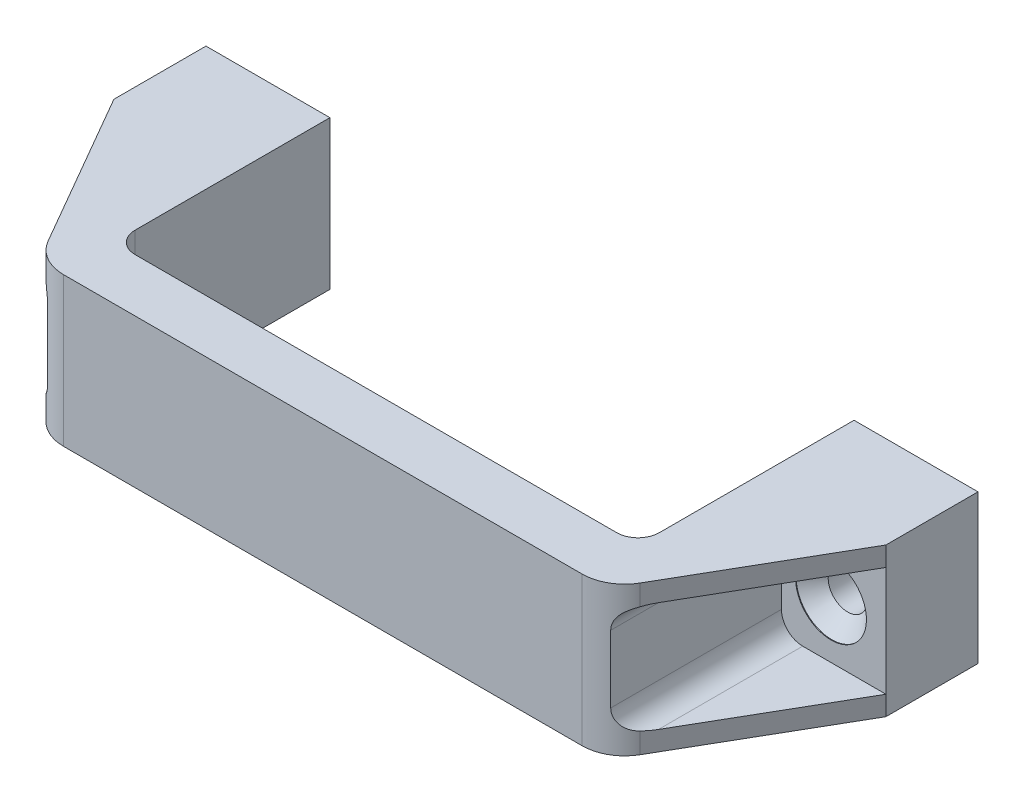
ISO-10303-21;
HEADER;
FILE_DESCRIPTION(('STEP AP214'),'2;1');
FILE_NAME('part.step','',(''),(''),'','','');
FILE_SCHEMA(('AUTOMOTIVE_DESIGN { 1 0 10303 214 1 1 1 1 }'));
ENDSEC;
DATA;
#1=APPLICATION_CONTEXT('core data for automotive mechanical design processes');
#2=APPLICATION_PROTOCOL_DEFINITION('international standard','automotive_design',2000,#1);
#3=PRODUCT_CONTEXT('',#1,'mechanical');
#4=PRODUCT('Part','Part','',(#3));
#5=PRODUCT_RELATED_PRODUCT_CATEGORY('part','',(#4));
#6=PRODUCT_DEFINITION_FORMATION('','',#4);
#7=PRODUCT_DEFINITION_CONTEXT('part definition',#1,'design');
#8=PRODUCT_DEFINITION('design','',#6,#7);
#9=PRODUCT_DEFINITION_SHAPE('','',#8);
#10=(LENGTH_UNIT() NAMED_UNIT(*) SI_UNIT(.MILLI.,.METRE.));
#11=(NAMED_UNIT(*) PLANE_ANGLE_UNIT() SI_UNIT($,.RADIAN.));
#12=(NAMED_UNIT(*) SI_UNIT($,.STERADIAN.) SOLID_ANGLE_UNIT());
#13=UNCERTAINTY_MEASURE_WITH_UNIT(LENGTH_MEASURE(1.E-05),#10,'distance_accuracy_value','');
#14=(GEOMETRIC_REPRESENTATION_CONTEXT(3) GLOBAL_UNCERTAINTY_ASSIGNED_CONTEXT((#13)) GLOBAL_UNIT_ASSIGNED_CONTEXT((#10,
#11,#12)) REPRESENTATION_CONTEXT('',''));
#15=CARTESIAN_POINT('',(0.,0.,0.));
#16=DIRECTION('',(0.,0.,1.));
#17=DIRECTION('',(1.,0.,0.));
#18=AXIS2_PLACEMENT_3D('',#15,#16,#17);
#19=CARTESIAN_POINT('',(0.,0.,12.8999999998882));
#20=DIRECTION('',(0.,0.,1.));
#21=DIRECTION('',(0.,-1.,0.));
#22=AXIS2_PLACEMENT_3D('',#19,#20,#21);
#23=CONICAL_SURFACE('',#22,4.99999999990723,0.785398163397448);
#24=CARTESIAN_POINT('',(0.,0.,10.65));
#25=DIRECTION('',(0.,0.,-1.));
#26=DIRECTION('',(0.,1.,0.));
#27=AXIS2_PLACEMENT_3D('',#24,#25,#26);
#28=CIRCLE('',#27,2.75);
#29=CARTESIAN_POINT('',(0.,2.75,10.65));
#30=VERTEX_POINT('',#29);
#31=EDGE_CURVE('E180',#30,#30,#28,.T.);
#32=ORIENTED_EDGE('',*,*,#31,.T.);
#33=EDGE_LOOP('',(#32));
#34=FACE_BOUND('',#33,.T.);
#35=CARTESIAN_POINT('',(0.,0.,12.9));
#36=DIRECTION('',(0.,0.,-1.));
#37=DIRECTION('',(0.,1.,0.));
#38=AXIS2_PLACEMENT_3D('',#35,#36,#37);
#39=CIRCLE('',#38,5.);
#40=CARTESIAN_POINT('',(0.,5.,12.9));
#41=VERTEX_POINT('',#40);
#42=EDGE_CURVE('E310',#41,#41,#39,.F.);
#43=ORIENTED_EDGE('',*,*,#42,.T.);
#44=EDGE_LOOP('',(#43));
#45=FACE_BOUND('',#44,.T.);
#46=ADVANCED_FACE('F14',(#34,#45),#23,.F.);
#47=CARTESIAN_POINT('',(93.5,0.,12.8999999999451));
#48=DIRECTION('',(0.,0.,1.));
#49=DIRECTION('',(0.,-1.,0.));
#50=AXIS2_PLACEMENT_3D('',#47,#48,#49);
#51=CONICAL_SURFACE('',#50,4.99999999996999,0.785398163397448);
#52=CARTESIAN_POINT('',(93.5,0.,10.65));
#53=DIRECTION('',(0.,0.,-1.));
#54=DIRECTION('',(0.,1.,0.));
#55=AXIS2_PLACEMENT_3D('',#52,#53,#54);
#56=CIRCLE('',#55,2.75);
#57=CARTESIAN_POINT('',(93.5,2.75,10.65));
#58=VERTEX_POINT('',#57);
#59=EDGE_CURVE('E302',#58,#58,#56,.T.);
#60=ORIENTED_EDGE('',*,*,#59,.T.);
#61=EDGE_LOOP('',(#60));
#62=FACE_BOUND('',#61,.T.);
#63=CARTESIAN_POINT('',(93.5,0.,12.9));
#64=DIRECTION('',(0.,0.,-1.));
#65=DIRECTION('',(0.,1.,0.));
#66=AXIS2_PLACEMENT_3D('',#63,#64,#65);
#67=CIRCLE('',#66,5.);
#68=CARTESIAN_POINT('',(93.5,5.,12.9));
#69=VERTEX_POINT('',#68);
#70=EDGE_CURVE('E181',#69,#69,#67,.F.);
#71=ORIENTED_EDGE('',*,*,#70,.T.);
#72=EDGE_LOOP('',(#71));
#73=FACE_BOUND('',#72,.T.);
#74=ADVANCED_FACE('F477',(#62,#73),#51,.F.);
#75=CARTESIAN_POINT('',(0.,0.,12.95));
#76=DIRECTION('',(0.,0.,-1.));
#77=DIRECTION('',(0.,1.,0.));
#78=AXIS2_PLACEMENT_3D('',#75,#76,#77);
#79=CYLINDRICAL_SURFACE('',#78,5.);
#80=ORIENTED_EDGE('',*,*,#42,.F.);
#81=EDGE_LOOP('',(#80));
#82=FACE_BOUND('',#81,.T.);
#83=CARTESIAN_POINT('',(0.,0.,12.999));
#84=DIRECTION('',(0.,0.,-1.));
#85=DIRECTION('',(0.,1.,0.));
#86=AXIS2_PLACEMENT_3D('',#83,#84,#85);
#87=CIRCLE('',#86,5.);
#88=CARTESIAN_POINT('',(0.,5.,12.999));
#89=VERTEX_POINT('',#88);
#90=EDGE_CURVE('E300',#89,#89,#87,.T.);
#91=ORIENTED_EDGE('',*,*,#90,.F.);
#92=EDGE_LOOP('',(#91));
#93=FACE_BOUND('',#92,.T.);
#94=ADVANCED_FACE('F474',(#82,#93),#79,.F.);
#95=CARTESIAN_POINT('',(93.5,0.,12.95));
#96=DIRECTION('',(0.,0.,-1.));
#97=DIRECTION('',(0.,1.,0.));
#98=AXIS2_PLACEMENT_3D('',#95,#96,#97);
#99=CYLINDRICAL_SURFACE('',#98,5.);
#100=ORIENTED_EDGE('',*,*,#70,.F.);
#101=EDGE_LOOP('',(#100));
#102=FACE_BOUND('',#101,.T.);
#103=CARTESIAN_POINT('',(93.5,0.,12.999));
#104=DIRECTION('',(0.,0.,-1.));
#105=DIRECTION('',(0.,1.,0.));
#106=AXIS2_PLACEMENT_3D('',#103,#104,#105);
#107=CIRCLE('',#106,5.);
#108=CARTESIAN_POINT('',(93.5,5.,12.999));
#109=VERTEX_POINT('',#108);
#110=EDGE_CURVE('E294',#109,#109,#107,.T.);
#111=ORIENTED_EDGE('',*,*,#110,.F.);
#112=EDGE_LOOP('',(#111));
#113=FACE_BOUND('',#112,.T.);
#114=ADVANCED_FACE('F471',(#102,#113),#99,.F.);
#115=CARTESIAN_POINT('',(-9.75,7.75,12.999));
#116=DIRECTION('',(0.,1.,0.));
#117=DIRECTION('',(-1.,0.,0.));
#118=AXIS2_PLACEMENT_3D('',#115,#116,#117);
#119=PLANE('',#118);
#120=DIRECTION('',(1.,0.,0.));
#121=VECTOR('',#120,1.);
#122=CARTESIAN_POINT('',(46.75,7.75,12.999));
#123=LINE('',#122,#121);
#124=CARTESIAN_POINT('',(4.,7.75,12.999));
#125=VERTEX_POINT('',#124);
#126=CARTESIAN_POINT('',(-7.75,7.75,12.999));
#127=VERTEX_POINT('',#126);
#128=EDGE_CURVE('E295',#125,#127,#123,.F.);
#129=ORIENTED_EDGE('',*,*,#128,.F.);
#130=DIRECTION('',(0.,0.,-1.));
#131=VECTOR('',#130,1.);
#132=CARTESIAN_POINT('',(4.,7.75,12.999));
#133=LINE('',#132,#131);
#134=CARTESIAN_POINT('',(4.,7.75,33.3515969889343));
#135=VERTEX_POINT('',#134);
#136=EDGE_CURVE('E186',#125,#135,#133,.F.);
#137=ORIENTED_EDGE('',*,*,#136,.T.);
#138=DIRECTION('',(-0.5,0.,-0.866025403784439));
#139=VECTOR('',#138,1.);
#140=CARTESIAN_POINT('',(4.9517059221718,7.75,35.));
#141=LINE('',#140,#139);
#142=CARTESIAN_POINT('',(-7.75,7.75,13.));
#143=VERTEX_POINT('',#142);
#144=EDGE_CURVE('E183',#143,#135,#141,.F.);
#145=ORIENTED_EDGE('',*,*,#144,.F.);
#146=DIRECTION('',(0.,0.,1.));
#147=VECTOR('',#146,1.);
#148=CARTESIAN_POINT('',(-7.75,7.75,13.));
#149=LINE('',#148,#147);
#150=EDGE_CURVE('E17',#127,#143,#149,.T.);
#151=ORIENTED_EDGE('',*,*,#150,.F.);
#152=EDGE_LOOP('',(#129,#137,#145,#151));
#153=FACE_BOUND('',#152,.T.);
#154=ADVANCED_FACE('F184',(#153),#119,.F.);
#155=CARTESIAN_POINT('',(0.,0.,5.325));
#156=DIRECTION('',(0.,0.,-1.));
#157=DIRECTION('',(0.,1.,0.));
#158=AXIS2_PLACEMENT_3D('',#155,#156,#157);
#159=CYLINDRICAL_SURFACE('',#158,2.75);
#160=CARTESIAN_POINT('',(0.,0.,0.));
#161=DIRECTION('',(0.,0.,-1.));
#162=DIRECTION('',(0.,1.,0.));
#163=AXIS2_PLACEMENT_3D('',#160,#161,#162);
#164=CIRCLE('',#163,2.75);
#165=CARTESIAN_POINT('',(0.,2.75,0.));
#166=VERTEX_POINT('',#165);
#167=EDGE_CURVE('E252',#166,#166,#164,.F.);
#168=ORIENTED_EDGE('',*,*,#167,.F.);
#169=EDGE_LOOP('',(#168));
#170=FACE_BOUND('',#169,.T.);
#171=ORIENTED_EDGE('',*,*,#31,.F.);
#172=EDGE_LOOP('',(#171));
#173=FACE_BOUND('',#172,.T.);
#174=ADVANCED_FACE('F464',(#170,#173),#159,.F.);
#175=CARTESIAN_POINT('',(93.5,0.,5.325));
#176=DIRECTION('',(0.,0.,-1.));
#177=DIRECTION('',(0.,1.,0.));
#178=AXIS2_PLACEMENT_3D('',#175,#176,#177);
#179=CYLINDRICAL_SURFACE('',#178,2.75);
#180=CARTESIAN_POINT('',(93.5,0.,0.));
#181=DIRECTION('',(0.,0.,-1.));
#182=DIRECTION('',(0.,1.,0.));
#183=AXIS2_PLACEMENT_3D('',#180,#181,#182);
#184=CIRCLE('',#183,2.75);
#185=CARTESIAN_POINT('',(93.5,2.75,0.));
#186=VERTEX_POINT('',#185);
#187=EDGE_CURVE('E238',#186,#186,#184,.F.);
#188=ORIENTED_EDGE('',*,*,#187,.F.);
#189=EDGE_LOOP('',(#188));
#190=FACE_BOUND('',#189,.T.);
#191=ORIENTED_EDGE('',*,*,#59,.F.);
#192=EDGE_LOOP('',(#191));
#193=FACE_BOUND('',#192,.T.);
#194=ADVANCED_FACE('F460',(#190,#193),#179,.F.);
#195=CARTESIAN_POINT('',(4.,-7.75,12.999));
#196=DIRECTION('',(0.,-1.,0.));
#197=DIRECTION('',(1.,0.,0.));
#198=AXIS2_PLACEMENT_3D('',#195,#196,#197);
#199=PLANE('',#198);
#200=DIRECTION('',(-0.5,0.,-0.866025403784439));
#201=VECTOR('',#200,1.);
#202=CARTESIAN_POINT('',(4.9517059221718,-7.75,35.));
#203=LINE('',#202,#201);
#204=CARTESIAN_POINT('',(4.,-7.75,33.3515969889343));
#205=VERTEX_POINT('',#204);
#206=CARTESIAN_POINT('',(-7.75,-7.75,13.));
#207=VERTEX_POINT('',#206);
#208=EDGE_CURVE('E206',#205,#207,#203,.T.);
#209=ORIENTED_EDGE('',*,*,#208,.F.);
#210=DIRECTION('',(0.,0.,-1.));
#211=VECTOR('',#210,1.);
#212=CARTESIAN_POINT('',(4.,-7.75,12.999));
#213=LINE('',#212,#211);
#214=CARTESIAN_POINT('',(4.,-7.75,12.999));
#215=VERTEX_POINT('',#214);
#216=EDGE_CURVE('E266',#205,#215,#213,.T.);
#217=ORIENTED_EDGE('',*,*,#216,.T.);
#218=DIRECTION('',(1.,0.,0.));
#219=VECTOR('',#218,1.);
#220=CARTESIAN_POINT('',(46.75,-7.75,12.999));
#221=LINE('',#220,#219);
#222=CARTESIAN_POINT('',(-7.75,-7.75,12.999));
#223=VERTEX_POINT('',#222);
#224=EDGE_CURVE('E297',#223,#215,#221,.T.);
#225=ORIENTED_EDGE('',*,*,#224,.F.);
#226=DIRECTION('',(0.,0.,1.));
#227=VECTOR('',#226,1.);
#228=CARTESIAN_POINT('',(-7.75,-7.75,13.));
#229=LINE('',#228,#227);
#230=EDGE_CURVE('E305',#207,#223,#229,.F.);
#231=ORIENTED_EDGE('',*,*,#230,.F.);
#232=EDGE_LOOP('',(#209,#217,#225,#231));
#233=FACE_BOUND('',#232,.T.);
#234=ADVANCED_FACE('F456',(#233),#199,.F.);
#235=CARTESIAN_POINT('',(46.75,0.,12.999));
#236=DIRECTION('',(0.,0.,1.));
#237=DIRECTION('',(0.,-1.,0.));
#238=AXIS2_PLACEMENT_3D('',#235,#236,#237);
#239=PLANE('',#238);
#240=CARTESIAN_POINT('',(4.,4.75,12.999));
#241=DIRECTION('',(0.,0.,-1.));
#242=DIRECTION('',(0.,1.,0.));
#243=AXIS2_PLACEMENT_3D('',#240,#241,#242);
#244=CIRCLE('',#243,3.);
#245=CARTESIAN_POINT('',(7.,4.75,12.999));
#246=VERTEX_POINT('',#245);
#247=EDGE_CURVE('E189',#246,#125,#244,.F.);
#248=ORIENTED_EDGE('',*,*,#247,.T.);
#249=ORIENTED_EDGE('',*,*,#128,.T.);
#250=DIRECTION('',(0.,-1.,0.));
#251=VECTOR('',#250,1.);
#252=CARTESIAN_POINT('',(-7.75,-10.5,12.999));
#253=LINE('',#252,#251);
#254=EDGE_CURVE('E179',#223,#127,#253,.F.);
#255=ORIENTED_EDGE('',*,*,#254,.F.);
#256=ORIENTED_EDGE('',*,*,#224,.T.);
#257=CARTESIAN_POINT('',(4.,-4.75,12.999));
#258=DIRECTION('',(0.,0.,-1.));
#259=DIRECTION('',(0.,1.,0.));
#260=AXIS2_PLACEMENT_3D('',#257,#258,#259);
#261=CIRCLE('',#260,3.);
#262=CARTESIAN_POINT('',(7.,-4.75,12.999));
#263=VERTEX_POINT('',#262);
#264=EDGE_CURVE('E190',#215,#263,#261,.F.);
#265=ORIENTED_EDGE('',*,*,#264,.T.);
#266=DIRECTION('',(0.,1.,0.));
#267=VECTOR('',#266,1.);
#268=CARTESIAN_POINT('',(7.,4.75,12.999));
#269=LINE('',#268,#267);
#270=EDGE_CURVE('E260',#263,#246,#269,.T.);
#271=ORIENTED_EDGE('',*,*,#270,.T.);
#272=EDGE_LOOP('',(#248,#249,#255,#256,#265,#271));
#273=FACE_BOUND('',#272,.T.);
#274=ORIENTED_EDGE('',*,*,#90,.T.);
#275=EDGE_LOOP('',(#274));
#276=FACE_BOUND('',#275,.T.);
#277=ADVANCED_FACE('F452',(#273,#276),#239,.T.);
#278=CARTESIAN_POINT('',(89.5,7.75,12.999));
#279=DIRECTION('',(0.,1.,0.));
#280=DIRECTION('',(-1.,0.,0.));
#281=AXIS2_PLACEMENT_3D('',#278,#279,#280);
#282=PLANE('',#281);
#283=DIRECTION('',(0.,0.,-1.));
#284=VECTOR('',#283,1.);
#285=CARTESIAN_POINT('',(89.5,7.75,12.999));
#286=LINE('',#285,#284);
#287=CARTESIAN_POINT('',(89.5,7.75,33.3515969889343));
#288=VERTEX_POINT('',#287);
#289=CARTESIAN_POINT('',(89.5,7.75,12.999));
#290=VERTEX_POINT('',#289);
#291=EDGE_CURVE('E529',#288,#290,#286,.T.);
#292=ORIENTED_EDGE('',*,*,#291,.T.);
#293=DIRECTION('',(1.,0.,0.));
#294=VECTOR('',#293,1.);
#295=CARTESIAN_POINT('',(46.75,7.75,12.999));
#296=LINE('',#295,#294);
#297=CARTESIAN_POINT('',(101.25,7.75,12.999));
#298=VERTEX_POINT('',#297);
#299=EDGE_CURVE('E291',#298,#290,#296,.F.);
#300=ORIENTED_EDGE('',*,*,#299,.F.);
#301=DIRECTION('',(0.,0.,1.));
#302=VECTOR('',#301,1.);
#303=CARTESIAN_POINT('',(101.25,7.75,0.));
#304=LINE('',#303,#302);
#305=CARTESIAN_POINT('',(101.25,7.75,13.));
#306=VERTEX_POINT('',#305);
#307=EDGE_CURVE('E229',#306,#298,#304,.F.);
#308=ORIENTED_EDGE('',*,*,#307,.F.);
#309=DIRECTION('',(-0.5,0.,0.866025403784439));
#310=VECTOR('',#309,1.);
#311=CARTESIAN_POINT('',(101.25,7.75,13.));
#312=LINE('',#311,#310);
#313=EDGE_CURVE('E277',#288,#306,#312,.F.);
#314=ORIENTED_EDGE('',*,*,#313,.F.);
#315=EDGE_LOOP('',(#292,#300,#308,#314));
#316=FACE_BOUND('',#315,.T.);
#317=ADVANCED_FACE('F448',(#316),#282,.F.);
#318=CARTESIAN_POINT('',(103.25,-7.75,12.999));
#319=DIRECTION('',(0.,-1.,0.));
#320=DIRECTION('',(1.,0.,0.));
#321=AXIS2_PLACEMENT_3D('',#318,#319,#320);
#322=PLANE('',#321);
#323=DIRECTION('',(0.,0.,1.));
#324=VECTOR('',#323,1.);
#325=CARTESIAN_POINT('',(101.25,-7.75,0.));
#326=LINE('',#325,#324);
#327=CARTESIAN_POINT('',(101.25,-7.75,12.999));
#328=VERTEX_POINT('',#327);
#329=CARTESIAN_POINT('',(101.25,-7.75,13.));
#330=VERTEX_POINT('',#329);
#331=EDGE_CURVE('E228',#328,#330,#326,.T.);
#332=ORIENTED_EDGE('',*,*,#331,.F.);
#333=DIRECTION('',(1.,0.,0.));
#334=VECTOR('',#333,1.);
#335=CARTESIAN_POINT('',(46.75,-7.75,12.999));
#336=LINE('',#335,#334);
#337=CARTESIAN_POINT('',(89.5,-7.75,12.999));
#338=VERTEX_POINT('',#337);
#339=EDGE_CURVE('E268',#338,#328,#336,.T.);
#340=ORIENTED_EDGE('',*,*,#339,.F.);
#341=DIRECTION('',(0.,0.,-1.));
#342=VECTOR('',#341,1.);
#343=CARTESIAN_POINT('',(89.5,-7.75,12.999));
#344=LINE('',#343,#342);
#345=CARTESIAN_POINT('',(89.5,-7.75,33.3515969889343));
#346=VERTEX_POINT('',#345);
#347=EDGE_CURVE('E522',#338,#346,#344,.F.);
#348=ORIENTED_EDGE('',*,*,#347,.T.);
#349=DIRECTION('',(-0.5,0.,0.866025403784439));
#350=VECTOR('',#349,1.);
#351=CARTESIAN_POINT('',(101.25,-7.75,13.));
#352=LINE('',#351,#350);
#353=EDGE_CURVE('E218',#330,#346,#352,.T.);
#354=ORIENTED_EDGE('',*,*,#353,.F.);
#355=EDGE_LOOP('',(#332,#340,#348,#354));
#356=FACE_BOUND('',#355,.T.);
#357=ADVANCED_FACE('F444',(#356),#322,.F.);
#358=CARTESIAN_POINT('',(46.75,0.,12.999));
#359=DIRECTION('',(0.,0.,1.));
#360=DIRECTION('',(0.,-1.,0.));
#361=AXIS2_PLACEMENT_3D('',#358,#359,#360);
#362=PLANE('',#361);
#363=CARTESIAN_POINT('',(89.5,-4.75,12.999));
#364=DIRECTION('',(0.,0.,-1.));
#365=DIRECTION('',(0.,1.,0.));
#366=AXIS2_PLACEMENT_3D('',#363,#364,#365);
#367=CIRCLE('',#366,3.);
#368=CARTESIAN_POINT('',(86.5,-4.75,12.999));
#369=VERTEX_POINT('',#368);
#370=EDGE_CURVE('E524',#369,#338,#367,.F.);
#371=ORIENTED_EDGE('',*,*,#370,.T.);
#372=ORIENTED_EDGE('',*,*,#339,.T.);
#373=DIRECTION('',(0.,1.,0.));
#374=VECTOR('',#373,1.);
#375=CARTESIAN_POINT('',(101.25,-10.5,12.999));
#376=LINE('',#375,#374);
#377=EDGE_CURVE('E225',#298,#328,#376,.F.);
#378=ORIENTED_EDGE('',*,*,#377,.F.);
#379=ORIENTED_EDGE('',*,*,#299,.T.);
#380=CARTESIAN_POINT('',(89.5,4.75,12.999));
#381=DIRECTION('',(0.,0.,-1.));
#382=DIRECTION('',(0.,1.,0.));
#383=AXIS2_PLACEMENT_3D('',#380,#381,#382);
#384=CIRCLE('',#383,3.);
#385=CARTESIAN_POINT('',(86.5,4.75,12.999));
#386=VERTEX_POINT('',#385);
#387=EDGE_CURVE('E530',#290,#386,#384,.F.);
#388=ORIENTED_EDGE('',*,*,#387,.T.);
#389=DIRECTION('',(0.,-1.,0.));
#390=VECTOR('',#389,1.);
#391=CARTESIAN_POINT('',(86.5,-4.75,12.999));
#392=LINE('',#391,#390);
#393=EDGE_CURVE('E286',#386,#369,#392,.T.);
#394=ORIENTED_EDGE('',*,*,#393,.T.);
#395=EDGE_LOOP('',(#371,#372,#378,#379,#388,#394));
#396=FACE_BOUND('',#395,.T.);
#397=ORIENTED_EDGE('',*,*,#110,.T.);
#398=EDGE_LOOP('',(#397));
#399=FACE_BOUND('',#398,.T.);
#400=ADVANCED_FACE('F440',(#396,#399),#362,.T.);
#401=CARTESIAN_POINT('',(4.,-4.75,12.999));
#402=DIRECTION('',(0.,0.,-1.));
#403=DIRECTION('',(0.,1.,0.));
#404=AXIS2_PLACEMENT_3D('',#401,#402,#403);
#405=CYLINDRICAL_SURFACE('',#404,3.);
#406=CARTESIAN_POINT('',(7.,-4.75,37.1079338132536));
#407=CARTESIAN_POINT('',(7.0000116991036,-4.82247066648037,37.1079293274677));
#408=CARTESIAN_POINT('',(6.99737420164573,-4.89493787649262,37.1063153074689));
#409=CARTESIAN_POINT('',(6.98688851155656,-5.03934288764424,37.0998371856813));
#410=CARTESIAN_POINT('',(6.97904070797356,-5.11128072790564,37.0949733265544));
#411=CARTESIAN_POINT('',(6.95823961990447,-5.25399513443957,37.0819754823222));
#412=CARTESIAN_POINT('',(6.94529496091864,-5.32477345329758,37.0738470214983));
#413=CARTESIAN_POINT('',(6.91449121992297,-5.46476363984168,37.0542721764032));
#414=CARTESIAN_POINT('',(6.89663219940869,-5.53397552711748,37.04282583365));
#415=CARTESIAN_POINT('',(6.83599464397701,-5.73858732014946,37.0033907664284));
#416=CARTESIAN_POINT('',(6.78614636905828,-5.8710252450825,36.9703005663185));
#417=CARTESIAN_POINT('',(6.67048431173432,-6.12400613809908,36.890069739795));
#418=CARTESIAN_POINT('',(6.60467280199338,-6.24455079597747,36.8429311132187));
#419=CARTESIAN_POINT('',(6.46029001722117,-6.47199280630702,36.7339263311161));
#420=CARTESIAN_POINT('',(6.38161738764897,-6.57876860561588,36.6719412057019));
#421=CARTESIAN_POINT('',(6.21648652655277,-6.77576643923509,36.5338590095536));
#422=CARTESIAN_POINT('',(6.13002894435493,-6.86598985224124,36.4577631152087));
#423=CARTESIAN_POINT('',(5.94774501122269,-7.03535450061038,36.2866914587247));
#424=CARTESIAN_POINT('',(5.85168638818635,-7.11327876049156,36.1907672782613));
#425=CARTESIAN_POINT('',(5.66064474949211,-7.25123870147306,35.9855484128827));
#426=CARTESIAN_POINT('',(5.56566426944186,-7.31123829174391,35.8762273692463));
#427=CARTESIAN_POINT('',(5.42616422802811,-7.3898828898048,35.7028758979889));
#428=CARTESIAN_POINT('',(5.37973156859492,-7.41438249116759,35.6429125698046));
#429=CARTESIAN_POINT('',(5.28853446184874,-7.45966220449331,35.5203404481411));
#430=CARTESIAN_POINT('',(5.24377029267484,-7.48044169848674,35.4577312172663));
#431=CARTESIAN_POINT('',(5.15646868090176,-7.51854483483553,35.3304585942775));
#432=CARTESIAN_POINT('',(5.11392128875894,-7.53588511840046,35.2658069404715));
#433=CARTESIAN_POINT('',(5.03107537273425,-7.56759499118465,35.1344182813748));
#434=CARTESIAN_POINT('',(4.99077563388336,-7.58196619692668,35.0676824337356));
#435=CARTESIAN_POINT('',(4.95170592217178,-7.59504056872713,35.));
#436=B_SPLINE_CURVE_WITH_KNOTS('',3,(#406,#407,#408,#409,#410,#411,#412,#413,#414,#415,#416,
#417,#418,#419,#420,#421,#422,#423,#424,#425,#426,#427,#428,#429,#430,#431,#432,#433,#434,#435),
.UNSPECIFIED.,.F.,.F.,(4,2,2,2,2,2,2,2,2,2,2,2,2,2,4),(0.,0.217339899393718,0.434663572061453,
0.651621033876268,0.868575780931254,1.30229924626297,1.73596099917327,2.17322148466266,
2.61044553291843,3.07825919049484,3.54700852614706,3.78598340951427,4.02499795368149,
4.26282614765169,4.50052451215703),.UNSPECIFIED.);
#437=CARTESIAN_POINT('',(7.,-4.75,37.1079338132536));
#438=VERTEX_POINT('',#437);
#439=CARTESIAN_POINT('',(4.95170592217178,-7.59504056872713,35.));
#440=VERTEX_POINT('',#439);
#441=EDGE_CURVE('E426',#438,#440,#436,.T.);
#442=ORIENTED_EDGE('',*,*,#441,.F.);
#443=DIRECTION('',(0.,0.,1.));
#444=VECTOR('',#443,1.);
#445=CARTESIAN_POINT('',(7.,-4.75,12.999));
#446=LINE('',#445,#444);
#447=EDGE_CURVE('E261',#438,#263,#446,.F.);
#448=ORIENTED_EDGE('',*,*,#447,.T.);
#449=ORIENTED_EDGE('',*,*,#264,.F.);
#450=ORIENTED_EDGE('',*,*,#216,.F.);
#451=CARTESIAN_POINT('',(4.,-4.75,33.3515969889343));
#452=DIRECTION('',(-0.866025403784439,0.,0.5));
#453=DIRECTION('',(-0.5,0.,-0.866025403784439));
#454=AXIS2_PLACEMENT_3D('',#451,#452,#453);
#455=ELLIPSE('',#454,6.,3.);
#456=EDGE_CURVE('E201',#440,#205,#455,.F.);
#457=ORIENTED_EDGE('',*,*,#456,.F.);
#458=EDGE_LOOP('',(#442,#448,#449,#450,#457));
#459=FACE_BOUND('',#458,.T.);
#460=ADVANCED_FACE('F436',(#459),#405,.F.);
#461=CARTESIAN_POINT('',(4.9517059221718,-10.5,35.));
#462=DIRECTION('',(-0.866025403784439,0.,0.5));
#463=DIRECTION('',(-0.5,0.,-0.866025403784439));
#464=AXIS2_PLACEMENT_3D('',#461,#462,#463);
#465=PLANE('',#464);
#466=DIRECTION('',(-0.5,0.,-0.866025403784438));
#467=VECTOR('',#466,1.);
#468=CARTESIAN_POINT('',(4.9517059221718,10.5,35.));
#469=LINE('',#468,#467);
#470=CARTESIAN_POINT('',(4.95170592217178,10.5,35.));
#471=VERTEX_POINT('',#470);
#472=CARTESIAN_POINT('',(-7.75,10.5,13.));
#473=VERTEX_POINT('',#472);
#474=EDGE_CURVE('E195',#471,#473,#469,.T.);
#475=ORIENTED_EDGE('',*,*,#474,.T.);
#476=DIRECTION('',(0.,-1.,0.));
#477=VECTOR('',#476,1.);
#478=CARTESIAN_POINT('',(-7.75,-10.5,13.));
#479=LINE('',#478,#477);
#480=EDGE_CURVE('E176',#143,#473,#479,.F.);
#481=ORIENTED_EDGE('',*,*,#480,.F.);
#482=ORIENTED_EDGE('',*,*,#144,.T.);
#483=CARTESIAN_POINT('',(4.,4.75,33.3515969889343));
#484=DIRECTION('',(-0.866025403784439,0.,0.5));
#485=DIRECTION('',(-0.5,0.,-0.866025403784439));
#486=AXIS2_PLACEMENT_3D('',#483,#484,#485);
#487=ELLIPSE('',#486,6.,3.);
#488=CARTESIAN_POINT('',(4.95170592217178,7.59504056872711,35.));
#489=VERTEX_POINT('',#488);
#490=EDGE_CURVE('E264',#135,#489,#487,.F.);
#491=ORIENTED_EDGE('',*,*,#490,.T.);
#492=DIRECTION('',(0.,-1.,0.));
#493=VECTOR('',#492,1.);
#494=CARTESIAN_POINT('',(4.95170592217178,-10.5,35.));
#495=LINE('',#494,#493);
#496=EDGE_CURVE('E415',#471,#489,#495,.T.);
#497=ORIENTED_EDGE('',*,*,#496,.F.);
#498=EDGE_LOOP('',(#475,#481,#482,#491,#497));
#499=FACE_BOUND('',#498,.T.);
#500=ADVANCED_FACE('F193',(#499),#465,.T.);
#501=CARTESIAN_POINT('',(4.,4.75,12.999));
#502=DIRECTION('',(0.,0.,-1.));
#503=DIRECTION('',(0.,1.,0.));
#504=AXIS2_PLACEMENT_3D('',#501,#502,#503);
#505=CYLINDRICAL_SURFACE('',#504,3.);
#506=ORIENTED_EDGE('',*,*,#136,.F.);
#507=ORIENTED_EDGE('',*,*,#247,.F.);
#508=DIRECTION('',(0.,0.,1.));
#509=VECTOR('',#508,1.);
#510=CARTESIAN_POINT('',(7.,4.75,12.999));
#511=LINE('',#510,#509);
#512=CARTESIAN_POINT('',(7.,4.75,37.1079338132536));
#513=VERTEX_POINT('',#512);
#514=EDGE_CURVE('E258',#246,#513,#511,.T.);
#515=ORIENTED_EDGE('',*,*,#514,.T.);
#516=CARTESIAN_POINT('',(4.95170592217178,7.59504056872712,35.));
#517=CARTESIAN_POINT('',(4.98310927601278,7.58453377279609,35.0543944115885));
#518=CARTESIAN_POINT('',(5.01529673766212,7.57319048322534,35.1081692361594));
#519=CARTESIAN_POINT('',(5.08114447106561,7.54863611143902,35.2143919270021));
#520=CARTESIAN_POINT('',(5.11480510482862,7.5354245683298,35.2668394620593));
#521=CARTESIAN_POINT('',(5.21802834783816,7.49262116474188,35.4223187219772));
#522=CARTESIAN_POINT('',(5.28964940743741,7.4599190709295,35.5231711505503));
#523=CARTESIAN_POINT('',(5.43751365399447,7.38447816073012,35.7185677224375));
#524=CARTESIAN_POINT('',(5.51378224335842,7.34167966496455,35.8130698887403));
#525=CARTESIAN_POINT('',(5.66860704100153,7.24481209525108,35.9938029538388));
#526=CARTESIAN_POINT('',(5.7471593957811,7.19076115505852,36.0800468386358));
#527=CARTESIAN_POINT('',(5.92451241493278,7.0547037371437,36.2642114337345));
#528=CARTESIAN_POINT('',(6.0233682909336,6.96908325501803,36.3595013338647));
#529=CARTESIAN_POINT('',(6.1672213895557,6.82551089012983,36.4898503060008));
#530=CARTESIAN_POINT('',(6.21436751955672,6.77521531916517,36.5311505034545));
#531=CARTESIAN_POINT('',(6.30650501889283,6.66961820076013,36.6095167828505));
#532=CARTESIAN_POINT('',(6.35149733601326,6.61431888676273,36.646584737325));
#533=CARTESIAN_POINT('',(6.43885071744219,6.49851459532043,36.716611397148));
#534=CARTESIAN_POINT('',(6.48119255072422,6.43797780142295,36.7495415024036));
#535=CARTESIAN_POINT('',(6.5621473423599,6.31236413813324,36.8109517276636));
#536=CARTESIAN_POINT('',(6.60076186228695,6.24728918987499,36.8394337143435));
#537=CARTESIAN_POINT('',(6.67364841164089,6.11288497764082,36.8920233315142));
#538=CARTESIAN_POINT('',(6.70791235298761,6.04354813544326,36.9161228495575));
#539=CARTESIAN_POINT('',(6.77138738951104,5.90129834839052,36.9599320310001));
#540=CARTESIAN_POINT('',(6.80059906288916,5.82838581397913,36.9796421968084));
#541=CARTESIAN_POINT('',(6.87544788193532,5.6175736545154,37.0293893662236));
#542=CARTESIAN_POINT('',(6.91453854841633,5.47606161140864,37.0543804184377));
#543=CARTESIAN_POINT('',(6.9715683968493,5.18744395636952,37.0904164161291));
#544=CARTESIAN_POINT('',(6.98956228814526,5.04035383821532,37.1014974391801));
#545=CARTESIAN_POINT('',(6.99773443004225,4.86900153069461,37.1065364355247));
#546=CARTESIAN_POINT('',(6.99858425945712,4.84519863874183,37.1070608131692));
#547=CARTESIAN_POINT('',(6.99971623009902,4.79759927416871,37.1077592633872));
#548=CARTESIAN_POINT('',(6.99999896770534,4.77380282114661,37.1079337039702));
#549=CARTESIAN_POINT('',(7.,4.75,37.1079338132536));
#550=B_SPLINE_CURVE_WITH_KNOTS('',3,(#516,#517,#518,#519,#520,#521,#522,#523,#524,#525,#526,
#527,#528,#529,#530,#531,#532,#533,#534,#535,#536,#537,#538,#539,#540,#541,#542,#543,#544,#545,
#546,#547,#548,#549),.UNSPECIFIED.,.F.,.F.,(4,2,2,2,2,2,2,2,2,2,2,2,2,2,2,2,4),(0.,
0.191018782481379,0.382084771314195,0.765322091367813,1.15088412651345,1.53582955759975,
2.0189407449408,2.2597851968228,2.50052267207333,2.74284191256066,2.98505918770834,
3.22772036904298,3.47035376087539,3.91479366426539,4.35807845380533,4.42954705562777,
4.50094045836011),.UNSPECIFIED.);
#551=EDGE_CURVE('E407',#489,#513,#550,.T.);
#552=ORIENTED_EDGE('',*,*,#551,.F.);
#553=ORIENTED_EDGE('',*,*,#490,.F.);
#554=EDGE_LOOP('',(#506,#507,#515,#552,#553));
#555=FACE_BOUND('',#554,.T.);
#556=ADVANCED_FACE('F399',(#555),#505,.F.);
#557=CARTESIAN_POINT('',(7.,4.75,12.999));
#558=DIRECTION('',(1.,0.,0.));
#559=DIRECTION('',(0.,1.,0.));
#560=AXIS2_PLACEMENT_3D('',#557,#558,#559);
#561=PLANE('',#560);
#562=ORIENTED_EDGE('',*,*,#514,.F.);
#563=ORIENTED_EDGE('',*,*,#270,.F.);
#564=ORIENTED_EDGE('',*,*,#447,.F.);
#565=DIRECTION('',(0.,-1.,0.));
#566=VECTOR('',#565,1.);
#567=CARTESIAN_POINT('',(7.,-10.5,37.1079338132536));
#568=LINE('',#567,#566);
#569=EDGE_CURVE('E256',#513,#438,#568,.T.);
#570=ORIENTED_EDGE('',*,*,#569,.F.);
#571=EDGE_LOOP('',(#562,#563,#564,#570));
#572=FACE_BOUND('',#571,.T.);
#573=ADVANCED_FACE('F395',(#572),#561,.F.);
#574=CARTESIAN_POINT('',(-7.75,-10.5,0.));
#575=DIRECTION('',(0.,0.,-1.));
#576=DIRECTION('',(0.,1.,0.));
#577=AXIS2_PLACEMENT_3D('',#574,#575,#576);
#578=PLANE('',#577);
#579=DIRECTION('',(1.,0.,0.));
#580=VECTOR('',#579,1.);
#581=CARTESIAN_POINT('',(46.75,-10.5,0.));
#582=LINE('',#581,#580);
#583=CARTESIAN_POINT('',(-7.75,-10.5,0.));
#584=VERTEX_POINT('',#583);
#585=CARTESIAN_POINT('',(9.75,-10.5,0.));
#586=VERTEX_POINT('',#585);
#587=EDGE_CURVE('E253',#584,#586,#582,.T.);
#588=ORIENTED_EDGE('',*,*,#587,.F.);
#589=DIRECTION('',(0.,-1.,0.));
#590=VECTOR('',#589,1.);
#591=CARTESIAN_POINT('',(-7.75,-10.5,0.));
#592=LINE('',#591,#590);
#593=CARTESIAN_POINT('',(-7.75,10.5,0.));
#594=VERTEX_POINT('',#593);
#595=EDGE_CURVE('E196',#594,#584,#592,.T.);
#596=ORIENTED_EDGE('',*,*,#595,.F.);
#597=DIRECTION('',(1.,0.,0.));
#598=VECTOR('',#597,1.);
#599=CARTESIAN_POINT('',(46.75,10.5,0.));
#600=LINE('',#599,#598);
#601=CARTESIAN_POINT('',(9.75,10.5,0.));
#602=VERTEX_POINT('',#601);
#603=EDGE_CURVE('E269',#594,#602,#600,.T.);
#604=ORIENTED_EDGE('',*,*,#603,.T.);
#605=DIRECTION('',(0.,1.,0.));
#606=VECTOR('',#605,1.);
#607=CARTESIAN_POINT('',(9.75,-10.5,0.));
#608=LINE('',#607,#606);
#609=EDGE_CURVE('E249',#586,#602,#608,.T.);
#610=ORIENTED_EDGE('',*,*,#609,.F.);
#611=EDGE_LOOP('',(#588,#596,#604,#610));
#612=FACE_BOUND('',#611,.T.);
#613=ORIENTED_EDGE('',*,*,#167,.T.);
#614=EDGE_LOOP('',(#613));
#615=FACE_BOUND('',#614,.T.);
#616=ADVANCED_FACE('F391',(#612,#615),#578,.T.);
#617=CARTESIAN_POINT('',(9.75,-10.5,0.));
#618=DIRECTION('',(1.,0.,0.));
#619=DIRECTION('',(0.,1.,0.));
#620=AXIS2_PLACEMENT_3D('',#617,#618,#619);
#621=PLANE('',#620);
#622=DIRECTION('',(0.,0.,1.));
#623=VECTOR('',#622,1.);
#624=CARTESIAN_POINT('',(9.75,-10.5,0.));
#625=LINE('',#624,#623);
#626=CARTESIAN_POINT('',(9.75,-10.5,27.5));
#627=VERTEX_POINT('',#626);
#628=EDGE_CURVE('E255',#586,#627,#625,.T.);
#629=ORIENTED_EDGE('',*,*,#628,.F.);
#630=ORIENTED_EDGE('',*,*,#609,.T.);
#631=DIRECTION('',(0.,0.,1.));
#632=VECTOR('',#631,1.);
#633=CARTESIAN_POINT('',(9.75,10.5,0.));
#634=LINE('',#633,#632);
#635=CARTESIAN_POINT('',(9.75,10.5,27.5));
#636=VERTEX_POINT('',#635);
#637=EDGE_CURVE('E272',#602,#636,#634,.T.);
#638=ORIENTED_EDGE('',*,*,#637,.T.);
#639=DIRECTION('',(0.,-1.,0.));
#640=VECTOR('',#639,1.);
#641=CARTESIAN_POINT('',(9.75,-10.5,27.5));
#642=LINE('',#641,#640);
#643=EDGE_CURVE('E247',#636,#627,#642,.T.);
#644=ORIENTED_EDGE('',*,*,#643,.T.);
#645=EDGE_LOOP('',(#629,#630,#638,#644));
#646=FACE_BOUND('',#645,.T.);
#647=ADVANCED_FACE('F387',(#646),#621,.T.);
#648=CARTESIAN_POINT('',(12.75,-10.5,27.5));
#649=DIRECTION('',(0.,-1.,0.));
#650=DIRECTION('',(1.,0.,0.));
#651=AXIS2_PLACEMENT_3D('',#648,#649,#650);
#652=CYLINDRICAL_SURFACE('',#651,3.);
#653=DIRECTION('',(0.,1.,0.));
#654=VECTOR('',#653,1.);
#655=CARTESIAN_POINT('',(12.75,-10.5,30.5));
#656=LINE('',#655,#654);
#657=CARTESIAN_POINT('',(12.75,-10.5,30.5));
#658=VERTEX_POINT('',#657);
#659=CARTESIAN_POINT('',(12.75,10.5,30.5));
#660=VERTEX_POINT('',#659);
#661=EDGE_CURVE('E244',#658,#660,#656,.T.);
#662=ORIENTED_EDGE('',*,*,#661,.F.);
#663=CARTESIAN_POINT('',(12.75,-10.5,27.5));
#664=DIRECTION('',(0.,-1.,0.));
#665=DIRECTION('',(1.,0.,0.));
#666=AXIS2_PLACEMENT_3D('',#663,#664,#665);
#667=CIRCLE('',#666,3.);
#668=EDGE_CURVE('E416',#627,#658,#667,.F.);
#669=ORIENTED_EDGE('',*,*,#668,.F.);
#670=ORIENTED_EDGE('',*,*,#643,.F.);
#671=CARTESIAN_POINT('',(12.75,10.5,27.5));
#672=DIRECTION('',(0.,-1.,0.));
#673=DIRECTION('',(1.,0.,0.));
#674=AXIS2_PLACEMENT_3D('',#671,#672,#673);
#675=CIRCLE('',#674,3.);
#676=EDGE_CURVE('E516',#636,#660,#675,.F.);
#677=ORIENTED_EDGE('',*,*,#676,.T.);
#678=EDGE_LOOP('',(#662,#669,#670,#677));
#679=FACE_BOUND('',#678,.T.);
#680=ADVANCED_FACE('F383',(#679),#652,.F.);
#681=CARTESIAN_POINT('',(12.75,-10.5,30.5));
#682=DIRECTION('',(0.,0.,-1.));
#683=DIRECTION('',(0.,1.,0.));
#684=AXIS2_PLACEMENT_3D('',#681,#682,#683);
#685=PLANE('',#684);
#686=DIRECTION('',(1.,0.,0.));
#687=VECTOR('',#686,1.);
#688=CARTESIAN_POINT('',(46.75,-10.5,30.5));
#689=LINE('',#688,#687);
#690=CARTESIAN_POINT('',(80.75,-10.5,30.5));
#691=VERTEX_POINT('',#690);
#692=EDGE_CURVE('E575',#658,#691,#689,.T.);
#693=ORIENTED_EDGE('',*,*,#692,.F.);
#694=ORIENTED_EDGE('',*,*,#661,.T.);
#695=DIRECTION('',(1.,0.,0.));
#696=VECTOR('',#695,1.);
#697=CARTESIAN_POINT('',(46.75,10.5,30.5));
#698=LINE('',#697,#696);
#699=CARTESIAN_POINT('',(80.75,10.5,30.5));
#700=VERTEX_POINT('',#699);
#701=EDGE_CURVE('E514',#660,#700,#698,.T.);
#702=ORIENTED_EDGE('',*,*,#701,.T.);
#703=DIRECTION('',(0.,-1.,0.));
#704=VECTOR('',#703,1.);
#705=CARTESIAN_POINT('',(80.75,-10.5,30.5));
#706=LINE('',#705,#704);
#707=EDGE_CURVE('E242',#700,#691,#706,.T.);
#708=ORIENTED_EDGE('',*,*,#707,.T.);
#709=EDGE_LOOP('',(#693,#694,#702,#708));
#710=FACE_BOUND('',#709,.T.);
#711=ADVANCED_FACE('F379',(#710),#685,.T.);
#712=CARTESIAN_POINT('',(80.75,-10.5,27.5));
#713=DIRECTION('',(0.,-1.,0.));
#714=DIRECTION('',(1.,0.,0.));
#715=AXIS2_PLACEMENT_3D('',#712,#713,#714);
#716=CYLINDRICAL_SURFACE('',#715,3.);
#717=DIRECTION('',(0.,-1.,0.));
#718=VECTOR('',#717,1.);
#719=CARTESIAN_POINT('',(83.75,-10.5,27.5));
#720=LINE('',#719,#718);
#721=CARTESIAN_POINT('',(83.75,-10.5,27.5));
#722=VERTEX_POINT('',#721);
#723=CARTESIAN_POINT('',(83.75,10.5,27.5));
#724=VERTEX_POINT('',#723);
#725=EDGE_CURVE('E239',#722,#724,#720,.F.);
#726=ORIENTED_EDGE('',*,*,#725,.F.);
#727=CARTESIAN_POINT('',(80.75,-10.5,27.5));
#728=DIRECTION('',(0.,-1.,0.));
#729=DIRECTION('',(1.,0.,0.));
#730=AXIS2_PLACEMENT_3D('',#727,#728,#729);
#731=CIRCLE('',#730,3.);
#732=EDGE_CURVE('E574',#691,#722,#731,.F.);
#733=ORIENTED_EDGE('',*,*,#732,.F.);
#734=ORIENTED_EDGE('',*,*,#707,.F.);
#735=CARTESIAN_POINT('',(80.75,10.5,27.5));
#736=DIRECTION('',(0.,-1.,0.));
#737=DIRECTION('',(1.,0.,0.));
#738=AXIS2_PLACEMENT_3D('',#735,#736,#737);
#739=CIRCLE('',#738,3.);
#740=EDGE_CURVE('E434',#700,#724,#739,.F.);
#741=ORIENTED_EDGE('',*,*,#740,.T.);
#742=EDGE_LOOP('',(#726,#733,#734,#741));
#743=FACE_BOUND('',#742,.T.);
#744=ADVANCED_FACE('F375',(#743),#716,.F.);
#745=CARTESIAN_POINT('',(83.75,-10.5,27.5));
#746=DIRECTION('',(-1.,0.,0.));
#747=DIRECTION('',(0.,-1.,0.));
#748=AXIS2_PLACEMENT_3D('',#745,#746,#747);
#749=PLANE('',#748);
#750=DIRECTION('',(0.,0.,1.));
#751=VECTOR('',#750,1.);
#752=CARTESIAN_POINT('',(83.75,-10.5,0.));
#753=LINE('',#752,#751);
#754=CARTESIAN_POINT('',(83.75,-10.5,0.));
#755=VERTEX_POINT('',#754);
#756=EDGE_CURVE('E234',#722,#755,#753,.F.);
#757=ORIENTED_EDGE('',*,*,#756,.F.);
#758=ORIENTED_EDGE('',*,*,#725,.T.);
#759=DIRECTION('',(0.,0.,1.));
#760=VECTOR('',#759,1.);
#761=CARTESIAN_POINT('',(83.75,10.5,0.));
#762=LINE('',#761,#760);
#763=CARTESIAN_POINT('',(83.75,10.5,0.));
#764=VERTEX_POINT('',#763);
#765=EDGE_CURVE('E285',#724,#764,#762,.F.);
#766=ORIENTED_EDGE('',*,*,#765,.T.);
#767=DIRECTION('',(0.,1.,0.));
#768=VECTOR('',#767,1.);
#769=CARTESIAN_POINT('',(83.75,-10.5,0.));
#770=LINE('',#769,#768);
#771=EDGE_CURVE('E235',#755,#764,#770,.T.);
#772=ORIENTED_EDGE('',*,*,#771,.F.);
#773=EDGE_LOOP('',(#757,#758,#766,#772));
#774=FACE_BOUND('',#773,.T.);
#775=ADVANCED_FACE('F371',(#774),#749,.T.);
#776=CARTESIAN_POINT('',(83.75,-10.5,0.));
#777=DIRECTION('',(0.,0.,-1.));
#778=DIRECTION('',(0.,1.,0.));
#779=AXIS2_PLACEMENT_3D('',#776,#777,#778);
#780=PLANE('',#779);
#781=DIRECTION('',(1.,0.,0.));
#782=VECTOR('',#781,1.);
#783=CARTESIAN_POINT('',(46.75,-10.5,0.));
#784=LINE('',#783,#782);
#785=CARTESIAN_POINT('',(101.25,-10.5,0.));
#786=VERTEX_POINT('',#785);
#787=EDGE_CURVE('E224',#755,#786,#784,.T.);
#788=ORIENTED_EDGE('',*,*,#787,.F.);
#789=ORIENTED_EDGE('',*,*,#771,.T.);
#790=DIRECTION('',(1.,0.,0.));
#791=VECTOR('',#790,1.);
#792=CARTESIAN_POINT('',(46.75,10.5,0.));
#793=LINE('',#792,#791);
#794=CARTESIAN_POINT('',(101.25,10.5,0.));
#795=VERTEX_POINT('',#794);
#796=EDGE_CURVE('E282',#764,#795,#793,.T.);
#797=ORIENTED_EDGE('',*,*,#796,.T.);
#798=DIRECTION('',(0.,1.,0.));
#799=VECTOR('',#798,1.);
#800=CARTESIAN_POINT('',(101.25,-10.5,0.));
#801=LINE('',#800,#799);
#802=EDGE_CURVE('E209',#786,#795,#801,.T.);
#803=ORIENTED_EDGE('',*,*,#802,.F.);
#804=EDGE_LOOP('',(#788,#789,#797,#803));
#805=FACE_BOUND('',#804,.T.);
#806=ORIENTED_EDGE('',*,*,#187,.T.);
#807=EDGE_LOOP('',(#806));
#808=FACE_BOUND('',#807,.T.);
#809=ADVANCED_FACE('F367',(#805,#808),#780,.T.);
#810=CARTESIAN_POINT('',(101.25,-10.5,0.));
#811=DIRECTION('',(1.,0.,0.));
#812=DIRECTION('',(0.,1.,0.));
#813=AXIS2_PLACEMENT_3D('',#810,#811,#812);
#814=PLANE('',#813);
#815=DIRECTION('',(0.,0.,1.));
#816=VECTOR('',#815,1.);
#817=CARTESIAN_POINT('',(101.25,10.5,0.));
#818=LINE('',#817,#816);
#819=CARTESIAN_POINT('',(101.25,10.5,13.));
#820=VERTEX_POINT('',#819);
#821=EDGE_CURVE('E278',#795,#820,#818,.T.);
#822=ORIENTED_EDGE('',*,*,#821,.T.);
#823=DIRECTION('',(0.,-1.,0.));
#824=VECTOR('',#823,1.);
#825=CARTESIAN_POINT('',(101.25,-10.5,13.));
#826=LINE('',#825,#824);
#827=EDGE_CURVE('E219',#306,#820,#826,.F.);
#828=ORIENTED_EDGE('',*,*,#827,.F.);
#829=ORIENTED_EDGE('',*,*,#307,.T.);
#830=ORIENTED_EDGE('',*,*,#377,.T.);
#831=ORIENTED_EDGE('',*,*,#331,.T.);
#832=DIRECTION('',(0.,-1.,0.));
#833=VECTOR('',#832,1.);
#834=CARTESIAN_POINT('',(101.25,-10.5,13.));
#835=LINE('',#834,#833);
#836=CARTESIAN_POINT('',(101.25,-10.5,13.));
#837=VERTEX_POINT('',#836);
#838=EDGE_CURVE('E215',#837,#330,#835,.F.);
#839=ORIENTED_EDGE('',*,*,#838,.F.);
#840=DIRECTION('',(0.,0.,1.));
#841=VECTOR('',#840,1.);
#842=CARTESIAN_POINT('',(101.25,-10.5,0.));
#843=LINE('',#842,#841);
#844=EDGE_CURVE('E220',#786,#837,#843,.T.);
#845=ORIENTED_EDGE('',*,*,#844,.F.);
#846=ORIENTED_EDGE('',*,*,#802,.T.);
#847=EDGE_LOOP('',(#822,#828,#829,#830,#831,#839,#845,#846));
#848=FACE_BOUND('',#847,.T.);
#849=ADVANCED_FACE('F363',(#848),#814,.T.);
#850=CARTESIAN_POINT('',(4.9517059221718,-10.5,35.));
#851=DIRECTION('',(-0.866025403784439,0.,0.5));
#852=DIRECTION('',(-0.5,0.,-0.866025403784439));
#853=AXIS2_PLACEMENT_3D('',#850,#851,#852);
#854=PLANE('',#853);
#855=DIRECTION('',(0.,-1.,0.));
#856=VECTOR('',#855,1.);
#857=CARTESIAN_POINT('',(4.95170592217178,-10.5,35.));
#858=LINE('',#857,#856);
#859=CARTESIAN_POINT('',(4.95170592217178,-10.5,35.));
#860=VERTEX_POINT('',#859);
#861=EDGE_CURVE('E433',#440,#860,#858,.T.);
#862=ORIENTED_EDGE('',*,*,#861,.F.);
#863=ORIENTED_EDGE('',*,*,#456,.T.);
#864=ORIENTED_EDGE('',*,*,#208,.T.);
#865=DIRECTION('',(0.,-1.,0.));
#866=VECTOR('',#865,1.);
#867=CARTESIAN_POINT('',(-7.75,-10.5,13.));
#868=LINE('',#867,#866);
#869=CARTESIAN_POINT('',(-7.75,-10.5,13.));
#870=VERTEX_POINT('',#869);
#871=EDGE_CURVE('E199',#870,#207,#868,.F.);
#872=ORIENTED_EDGE('',*,*,#871,.F.);
#873=DIRECTION('',(-0.5,0.,-0.866025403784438));
#874=VECTOR('',#873,1.);
#875=CARTESIAN_POINT('',(4.9517059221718,-10.5,35.));
#876=LINE('',#875,#874);
#877=EDGE_CURVE('E214',#860,#870,#876,.T.);
#878=ORIENTED_EDGE('',*,*,#877,.F.);
#879=EDGE_LOOP('',(#862,#863,#864,#872,#878));
#880=FACE_BOUND('',#879,.T.);
#881=ADVANCED_FACE('F360',(#880),#854,.T.);
#882=CARTESIAN_POINT('',(-7.75,-10.5,13.));
#883=DIRECTION('',(-1.,0.,0.));
#884=DIRECTION('',(0.,-1.,0.));
#885=AXIS2_PLACEMENT_3D('',#882,#883,#884);
#886=PLANE('',#885);
#887=DIRECTION('',(0.,0.,1.));
#888=VECTOR('',#887,1.);
#889=CARTESIAN_POINT('',(-7.75,-10.5,0.));
#890=LINE('',#889,#888);
#891=EDGE_CURVE('E210',#870,#584,#890,.F.);
#892=ORIENTED_EDGE('',*,*,#891,.F.);
#893=ORIENTED_EDGE('',*,*,#871,.T.);
#894=ORIENTED_EDGE('',*,*,#230,.T.);
#895=ORIENTED_EDGE('',*,*,#254,.T.);
#896=ORIENTED_EDGE('',*,*,#150,.T.);
#897=ORIENTED_EDGE('',*,*,#480,.T.);
#898=DIRECTION('',(0.,0.,1.));
#899=VECTOR('',#898,1.);
#900=CARTESIAN_POINT('',(-7.75,10.5,0.));
#901=LINE('',#900,#899);
#902=EDGE_CURVE('E273',#473,#594,#901,.F.);
#903=ORIENTED_EDGE('',*,*,#902,.T.);
#904=ORIENTED_EDGE('',*,*,#595,.T.);
#905=EDGE_LOOP('',(#892,#893,#894,#895,#896,#897,#903,#904));
#906=FACE_BOUND('',#905,.T.);
#907=ADVANCED_FACE('F172',(#906),#886,.T.);
#908=CARTESIAN_POINT('',(89.5,4.75,12.999));
#909=DIRECTION('',(0.,0.,-1.));
#910=DIRECTION('',(0.,1.,0.));
#911=AXIS2_PLACEMENT_3D('',#908,#909,#910);
#912=CYLINDRICAL_SURFACE('',#911,3.);
#913=DIRECTION('',(0.,0.,1.));
#914=VECTOR('',#913,1.);
#915=CARTESIAN_POINT('',(86.5,4.75,12.999));
#916=LINE('',#915,#914);
#917=CARTESIAN_POINT('',(86.5,4.75,37.1079338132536));
#918=VERTEX_POINT('',#917);
#919=EDGE_CURVE('E289',#918,#386,#916,.F.);
#920=ORIENTED_EDGE('',*,*,#919,.T.);
#921=ORIENTED_EDGE('',*,*,#387,.F.);
#922=ORIENTED_EDGE('',*,*,#291,.F.);
#923=CARTESIAN_POINT('',(89.5,4.75,33.3515969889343));
#924=DIRECTION('',(0.866025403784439,0.,0.5));
#925=DIRECTION('',(0.5,0.,-0.866025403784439));
#926=AXIS2_PLACEMENT_3D('',#923,#924,#925);
#927=ELLIPSE('',#926,6.,3.);
#928=CARTESIAN_POINT('',(88.5482940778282,7.59504056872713,35.));
#929=VERTEX_POINT('',#928);
#930=EDGE_CURVE('E528',#929,#288,#927,.F.);
#931=ORIENTED_EDGE('',*,*,#930,.F.);
#932=CARTESIAN_POINT('',(86.5,4.75,37.1079338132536));
#933=CARTESIAN_POINT('',(86.4999883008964,4.82247066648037,37.1079293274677));
#934=CARTESIAN_POINT('',(86.5026257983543,4.89493787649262,37.1063153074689));
#935=CARTESIAN_POINT('',(86.5131114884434,5.03934288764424,37.0998371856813));
#936=CARTESIAN_POINT('',(86.5209592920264,5.11128072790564,37.0949733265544));
#937=CARTESIAN_POINT('',(86.5417603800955,5.25399513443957,37.0819754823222));
#938=CARTESIAN_POINT('',(86.5547050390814,5.32477345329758,37.0738470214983));
#939=CARTESIAN_POINT('',(86.585508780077,5.46476363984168,37.0542721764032));
#940=CARTESIAN_POINT('',(86.6033678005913,5.53397552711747,37.04282583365));
#941=CARTESIAN_POINT('',(86.664005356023,5.73858732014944,37.0033907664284));
#942=CARTESIAN_POINT('',(86.7138536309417,5.87102524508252,36.9703005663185));
#943=CARTESIAN_POINT('',(86.8295156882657,6.1240061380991,36.890069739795));
#944=CARTESIAN_POINT('',(86.8953271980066,6.24455079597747,36.8429311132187));
#945=CARTESIAN_POINT('',(87.0397099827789,6.47199280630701,36.7339263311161));
#946=CARTESIAN_POINT('',(87.1183826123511,6.57876860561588,36.6719412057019));
#947=CARTESIAN_POINT('',(87.2835134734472,6.7757664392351,36.5338590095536));
#948=CARTESIAN_POINT('',(87.369971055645,6.86598985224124,36.4577631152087));
#949=CARTESIAN_POINT('',(87.5522549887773,7.03535450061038,36.2866914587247));
#950=CARTESIAN_POINT('',(87.6483136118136,7.11327876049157,36.1907672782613));
#951=CARTESIAN_POINT('',(87.8393552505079,7.25123870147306,35.9855484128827));
#952=CARTESIAN_POINT('',(87.9343357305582,7.3112382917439,35.8762273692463));
#953=CARTESIAN_POINT('',(88.0738357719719,7.3898828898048,35.7028758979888));
#954=CARTESIAN_POINT('',(88.1202684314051,7.4143824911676,35.6429125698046));
#955=CARTESIAN_POINT('',(88.2114655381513,7.45966220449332,35.5203404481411));
#956=CARTESIAN_POINT('',(88.2562297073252,7.48044169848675,35.4577312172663));
#957=CARTESIAN_POINT('',(88.3435313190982,7.51854483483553,35.3304585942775));
#958=CARTESIAN_POINT('',(88.3860787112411,7.53588511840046,35.2658069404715));
#959=CARTESIAN_POINT('',(88.4689246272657,7.56759499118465,35.1344182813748));
#960=CARTESIAN_POINT('',(88.5092243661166,7.58196619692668,35.0676824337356));
#961=CARTESIAN_POINT('',(88.5482940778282,7.59504056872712,35.));
#962=B_SPLINE_CURVE_WITH_KNOTS('',3,(#932,#933,#934,#935,#936,#937,#938,#939,#940,#941,#942,
#943,#944,#945,#946,#947,#948,#949,#950,#951,#952,#953,#954,#955,#956,#957,#958,#959,#960,#961),
.UNSPECIFIED.,.F.,.F.,(4,2,2,2,2,2,2,2,2,2,2,2,2,2,4),(0.,0.217339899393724,0.434663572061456,
0.651621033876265,0.868575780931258,1.30229924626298,1.73596099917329,2.17322148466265,
2.61044553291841,3.07825919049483,3.54700852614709,3.78598340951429,4.02499795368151,
4.26282614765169,4.50052451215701),.UNSPECIFIED.);
#963=EDGE_CURVE('E213',#918,#929,#962,.T.);
#964=ORIENTED_EDGE('',*,*,#963,.F.);
#965=EDGE_LOOP('',(#920,#921,#922,#931,#964));
#966=FACE_BOUND('',#965,.T.);
#967=ADVANCED_FACE('F351',(#966),#912,.F.);
#968=CARTESIAN_POINT('',(101.25,-10.5,13.));
#969=DIRECTION('',(0.866025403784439,0.,0.5));
#970=DIRECTION('',(-0.5,0.,0.866025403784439));
#971=AXIS2_PLACEMENT_3D('',#968,#969,#970);
#972=PLANE('',#971);
#973=DIRECTION('',(-0.5,0.,0.866025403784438));
#974=VECTOR('',#973,1.);
#975=CARTESIAN_POINT('',(101.25,10.5,13.));
#976=LINE('',#975,#974);
#977=CARTESIAN_POINT('',(88.5482940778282,10.5,35.));
#978=VERTEX_POINT('',#977);
#979=EDGE_CURVE('E281',#820,#978,#976,.T.);
#980=ORIENTED_EDGE('',*,*,#979,.T.);
#981=DIRECTION('',(0.,-1.,0.));
#982=VECTOR('',#981,1.);
#983=CARTESIAN_POINT('',(88.5482940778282,-10.5,35.));
#984=LINE('',#983,#982);
#985=EDGE_CURVE('E347',#929,#978,#984,.F.);
#986=ORIENTED_EDGE('',*,*,#985,.F.);
#987=ORIENTED_EDGE('',*,*,#930,.T.);
#988=ORIENTED_EDGE('',*,*,#313,.T.);
#989=ORIENTED_EDGE('',*,*,#827,.T.);
#990=EDGE_LOOP('',(#980,#986,#987,#988,#989));
#991=FACE_BOUND('',#990,.T.);
#992=ADVANCED_FACE('F356',(#991),#972,.T.);
#993=CARTESIAN_POINT('',(101.25,-10.5,13.));
#994=DIRECTION('',(0.866025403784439,0.,0.5));
#995=DIRECTION('',(-0.5,0.,0.866025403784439));
#996=AXIS2_PLACEMENT_3D('',#993,#994,#995);
#997=PLANE('',#996);
#998=ORIENTED_EDGE('',*,*,#838,.T.);
#999=ORIENTED_EDGE('',*,*,#353,.T.);
#1000=CARTESIAN_POINT('',(89.5,-4.75,33.3515969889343));
#1001=DIRECTION('',(0.866025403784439,0.,0.5));
#1002=DIRECTION('',(0.5,0.,-0.866025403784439));
#1003=AXIS2_PLACEMENT_3D('',#1000,#1001,#1002);
#1004=ELLIPSE('',#1003,6.,3.);
#1005=CARTESIAN_POINT('',(88.5482940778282,-7.59504056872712,35.));
#1006=VERTEX_POINT('',#1005);
#1007=EDGE_CURVE('E521',#346,#1006,#1004,.F.);
#1008=ORIENTED_EDGE('',*,*,#1007,.T.);
#1009=DIRECTION('',(0.,-1.,0.));
#1010=VECTOR('',#1009,1.);
#1011=CARTESIAN_POINT('',(88.5482940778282,-10.5,35.));
#1012=LINE('',#1011,#1010);
#1013=CARTESIAN_POINT('',(88.5482940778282,-10.5,35.));
#1014=VERTEX_POINT('',#1013);
#1015=EDGE_CURVE('E323',#1014,#1006,#1012,.F.);
#1016=ORIENTED_EDGE('',*,*,#1015,.F.);
#1017=DIRECTION('',(-0.5,0.,0.866025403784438));
#1018=VECTOR('',#1017,1.);
#1019=CARTESIAN_POINT('',(101.25,-10.5,13.));
#1020=LINE('',#1019,#1018);
#1021=EDGE_CURVE('E223',#837,#1014,#1020,.T.);
#1022=ORIENTED_EDGE('',*,*,#1021,.F.);
#1023=EDGE_LOOP('',(#998,#999,#1008,#1016,#1022));
#1024=FACE_BOUND('',#1023,.T.);
#1025=ADVANCED_FACE('F596',(#1024),#997,.T.);
#1026=CARTESIAN_POINT('',(89.5,-4.75,12.999));
#1027=DIRECTION('',(0.,0.,-1.));
#1028=DIRECTION('',(0.,1.,0.));
#1029=AXIS2_PLACEMENT_3D('',#1026,#1027,#1028);
#1030=CYLINDRICAL_SURFACE('',#1029,3.);
#1031=ORIENTED_EDGE('',*,*,#1007,.F.);
#1032=ORIENTED_EDGE('',*,*,#347,.F.);
#1033=ORIENTED_EDGE('',*,*,#370,.F.);
#1034=DIRECTION('',(0.,0.,1.));
#1035=VECTOR('',#1034,1.);
#1036=CARTESIAN_POINT('',(86.5,-4.75,12.999));
#1037=LINE('',#1036,#1035);
#1038=CARTESIAN_POINT('',(86.5,-4.75,37.1079338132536));
#1039=VERTEX_POINT('',#1038);
#1040=EDGE_CURVE('E288',#369,#1039,#1037,.T.);
#1041=ORIENTED_EDGE('',*,*,#1040,.T.);
#1042=CARTESIAN_POINT('',(88.5482940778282,-7.59504056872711,35.));
#1043=CARTESIAN_POINT('',(88.5168907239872,-7.58453377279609,35.0543944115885));
#1044=CARTESIAN_POINT('',(88.4847032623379,-7.57319048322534,35.1081692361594));
#1045=CARTESIAN_POINT('',(88.4188555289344,-7.54863611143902,35.2143919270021));
#1046=CARTESIAN_POINT('',(88.3851948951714,-7.5354245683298,35.2668394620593));
#1047=CARTESIAN_POINT('',(88.2819716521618,-7.49262116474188,35.4223187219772));
#1048=CARTESIAN_POINT('',(88.2103505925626,-7.4599190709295,35.5231711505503));
#1049=CARTESIAN_POINT('',(88.0624863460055,-7.38447816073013,35.7185677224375));
#1050=CARTESIAN_POINT('',(87.9862177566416,-7.34167966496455,35.8130698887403));
#1051=CARTESIAN_POINT('',(87.8313929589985,-7.24481209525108,35.9938029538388));
#1052=CARTESIAN_POINT('',(87.7528406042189,-7.19076115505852,36.0800468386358));
#1053=CARTESIAN_POINT('',(87.5754875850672,-7.0547037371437,36.2642114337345));
#1054=CARTESIAN_POINT('',(87.4766317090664,-6.96908325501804,36.3595013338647));
#1055=CARTESIAN_POINT('',(87.3327786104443,-6.82551089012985,36.4898503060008));
#1056=CARTESIAN_POINT('',(87.2856324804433,-6.77521531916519,36.5311505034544));
#1057=CARTESIAN_POINT('',(87.1934949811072,-6.66961820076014,36.6095167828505));
#1058=CARTESIAN_POINT('',(87.1485026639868,-6.61431888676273,36.646584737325));
#1059=CARTESIAN_POINT('',(87.0611492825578,-6.49851459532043,36.716611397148));
#1060=CARTESIAN_POINT('',(87.0188074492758,-6.43797780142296,36.7495415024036));
#1061=CARTESIAN_POINT('',(86.9378526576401,-6.31236413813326,36.8109517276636));
#1062=CARTESIAN_POINT('',(86.8992381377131,-6.24728918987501,36.8394337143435));
#1063=CARTESIAN_POINT('',(86.8263515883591,-6.11288497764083,36.8920233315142));
#1064=CARTESIAN_POINT('',(86.7920876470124,-6.04354813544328,36.9161228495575));
#1065=CARTESIAN_POINT('',(86.728612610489,-5.90129834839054,36.9599320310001));
#1066=CARTESIAN_POINT('',(86.6994009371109,-5.82838581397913,36.9796421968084));
#1067=CARTESIAN_POINT('',(86.6245521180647,-5.6175736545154,37.0293893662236));
#1068=CARTESIAN_POINT('',(86.5854614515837,-5.47606161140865,37.0543804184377));
#1069=CARTESIAN_POINT('',(86.5284316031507,-5.18744395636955,37.0904164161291));
#1070=CARTESIAN_POINT('',(86.5104377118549,-5.04035383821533,37.1014974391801));
#1071=CARTESIAN_POINT('',(86.5022655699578,-4.86900153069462,37.1065364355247));
#1072=CARTESIAN_POINT('',(86.5014157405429,-4.84519863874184,37.1070608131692));
#1073=CARTESIAN_POINT('',(86.500283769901,-4.79759927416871,37.1077592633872));
#1074=CARTESIAN_POINT('',(86.5000010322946,-4.77380282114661,37.1079337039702));
#1075=CARTESIAN_POINT('',(86.5,-4.75,37.1079338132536));
#1076=B_SPLINE_CURVE_WITH_KNOTS('',3,(#1042,#1043,#1044,#1045,#1046,#1047,#1048,#1049,#1050,
#1051,#1052,#1053,#1054,#1055,#1056,#1057,#1058,#1059,#1060,#1061,#1062,#1063,#1064,#1065,#1066,
#1067,#1068,#1069,#1070,#1071,#1072,#1073,#1074,#1075),.UNSPECIFIED.,.F.,.F.,(4,2,2,2,2,2,2,2,2,
2,2,2,2,2,2,2,4),(0.,0.191018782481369,0.382084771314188,0.765322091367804,1.15088412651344,
1.53582955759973,2.01894074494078,2.25978519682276,2.5005226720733,2.74284191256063,
2.98505918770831,3.22772036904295,3.47035376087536,3.91479366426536,4.35807845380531,
4.42954705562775,4.5009404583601),.UNSPECIFIED.);
#1077=EDGE_CURVE('E313',#1006,#1039,#1076,.T.);
#1078=ORIENTED_EDGE('',*,*,#1077,.F.);
#1079=EDGE_LOOP('',(#1031,#1032,#1033,#1041,#1078));
#1080=FACE_BOUND('',#1079,.T.);
#1081=ADVANCED_FACE('F325',(#1080),#1030,.F.);
#1082=CARTESIAN_POINT('',(86.5,-4.75,12.999));
#1083=DIRECTION('',(-1.,0.,0.));
#1084=DIRECTION('',(0.,-1.,0.));
#1085=AXIS2_PLACEMENT_3D('',#1082,#1083,#1084);
#1086=PLANE('',#1085);
#1087=ORIENTED_EDGE('',*,*,#1040,.F.);
#1088=ORIENTED_EDGE('',*,*,#393,.F.);
#1089=ORIENTED_EDGE('',*,*,#919,.F.);
#1090=DIRECTION('',(0.,-1.,0.));
#1091=VECTOR('',#1090,1.);
#1092=CARTESIAN_POINT('',(86.5,-10.5,37.1079338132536));
#1093=LINE('',#1092,#1091);
#1094=EDGE_CURVE('E322',#1039,#918,#1093,.F.);
#1095=ORIENTED_EDGE('',*,*,#1094,.F.);
#1096=EDGE_LOOP('',(#1087,#1088,#1089,#1095));
#1097=FACE_BOUND('',#1096,.T.);
#1098=ADVANCED_FACE('F664',(#1097),#1086,.F.);
#1099=CARTESIAN_POINT('',(46.75,10.5,0.));
#1100=DIRECTION('',(0.,-1.,0.));
#1101=DIRECTION('',(1.,0.,0.));
#1102=AXIS2_PLACEMENT_3D('',#1099,#1100,#1101);
#1103=PLANE('',#1102);
#1104=ORIENTED_EDGE('',*,*,#603,.F.);
#1105=ORIENTED_EDGE('',*,*,#902,.F.);
#1106=ORIENTED_EDGE('',*,*,#474,.F.);
#1107=CARTESIAN_POINT('',(10.1478583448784,10.5,32.));
#1108=DIRECTION('',(0.,-1.,0.));
#1109=DIRECTION('',(1.,0.,0.));
#1110=AXIS2_PLACEMENT_3D('',#1107,#1108,#1109);
#1111=CIRCLE('',#1110,6.);
#1112=CARTESIAN_POINT('',(10.1478583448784,10.5,38.));
#1113=VERTEX_POINT('',#1112);
#1114=EDGE_CURVE('E417',#1113,#471,#1111,.T.);
#1115=ORIENTED_EDGE('',*,*,#1114,.F.);
#1116=DIRECTION('',(1.,0.,0.));
#1117=VECTOR('',#1116,1.);
#1118=CARTESIAN_POINT('',(46.75,10.5,38.));
#1119=LINE('',#1118,#1117);
#1120=CARTESIAN_POINT('',(83.3521416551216,10.5,38.));
#1121=VERTEX_POINT('',#1120);
#1122=EDGE_CURVE('E498',#1121,#1113,#1119,.F.);
#1123=ORIENTED_EDGE('',*,*,#1122,.F.);
#1124=CARTESIAN_POINT('',(83.3521416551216,10.5,32.));
#1125=DIRECTION('',(0.,-1.,0.));
#1126=DIRECTION('',(1.,0.,0.));
#1127=AXIS2_PLACEMENT_3D('',#1124,#1125,#1126);
#1128=CIRCLE('',#1127,6.);
#1129=EDGE_CURVE('E348',#978,#1121,#1128,.T.);
#1130=ORIENTED_EDGE('',*,*,#1129,.F.);
#1131=ORIENTED_EDGE('',*,*,#979,.F.);
#1132=ORIENTED_EDGE('',*,*,#821,.F.);
#1133=ORIENTED_EDGE('',*,*,#796,.F.);
#1134=ORIENTED_EDGE('',*,*,#765,.F.);
#1135=ORIENTED_EDGE('',*,*,#740,.F.);
#1136=ORIENTED_EDGE('',*,*,#701,.F.);
#1137=ORIENTED_EDGE('',*,*,#676,.F.);
#1138=ORIENTED_EDGE('',*,*,#637,.F.);
#1139=EDGE_LOOP('',(#1104,#1105,#1106,#1115,#1123,#1130,#1131,#1132,#1133,#1134,#1135,#1136,
#1137,#1138));
#1140=FACE_BOUND('',#1139,.T.);
#1141=ADVANCED_FACE('F423',(#1140),#1103,.F.);
#1142=CARTESIAN_POINT('',(10.1478583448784,-10.5,32.));
#1143=DIRECTION('',(0.,-1.,0.));
#1144=DIRECTION('',(1.,0.,0.));
#1145=AXIS2_PLACEMENT_3D('',#1142,#1143,#1144);
#1146=CYLINDRICAL_SURFACE('',#1145,6.);
#1147=ORIENTED_EDGE('',*,*,#551,.T.);
#1148=ORIENTED_EDGE('',*,*,#569,.T.);
#1149=ORIENTED_EDGE('',*,*,#441,.T.);
#1150=ORIENTED_EDGE('',*,*,#861,.T.);
#1151=CARTESIAN_POINT('',(10.1478583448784,-10.5,32.));
#1152=DIRECTION('',(0.,-1.,0.));
#1153=DIRECTION('',(1.,0.,0.));
#1154=AXIS2_PLACEMENT_3D('',#1151,#1152,#1153);
#1155=CIRCLE('',#1154,6.);
#1156=CARTESIAN_POINT('',(10.1478583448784,-10.5,38.));
#1157=VERTEX_POINT('',#1156);
#1158=EDGE_CURVE('E349',#1157,#860,#1155,.T.);
#1159=ORIENTED_EDGE('',*,*,#1158,.F.);
#1160=DIRECTION('',(0.,-1.,0.));
#1161=VECTOR('',#1160,1.);
#1162=CARTESIAN_POINT('',(10.1478583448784,-10.5,38.));
#1163=LINE('',#1162,#1161);
#1164=EDGE_CURVE('E495',#1113,#1157,#1163,.T.);
#1165=ORIENTED_EDGE('',*,*,#1164,.F.);
#1166=ORIENTED_EDGE('',*,*,#1114,.T.);
#1167=ORIENTED_EDGE('',*,*,#496,.T.);
#1168=EDGE_LOOP('',(#1147,#1148,#1149,#1150,#1159,#1165,#1166,#1167));
#1169=FACE_BOUND('',#1168,.T.);
#1170=ADVANCED_FACE('F419',(#1169),#1146,.T.);
#1171=CARTESIAN_POINT('',(46.75,-10.5,0.));
#1172=DIRECTION('',(0.,-1.,0.));
#1173=DIRECTION('',(1.,0.,0.));
#1174=AXIS2_PLACEMENT_3D('',#1171,#1172,#1173);
#1175=PLANE('',#1174);
#1176=ORIENTED_EDGE('',*,*,#877,.T.);
#1177=ORIENTED_EDGE('',*,*,#891,.T.);
#1178=ORIENTED_EDGE('',*,*,#587,.T.);
#1179=ORIENTED_EDGE('',*,*,#628,.T.);
#1180=ORIENTED_EDGE('',*,*,#668,.T.);
#1181=ORIENTED_EDGE('',*,*,#692,.T.);
#1182=ORIENTED_EDGE('',*,*,#732,.T.);
#1183=ORIENTED_EDGE('',*,*,#756,.T.);
#1184=ORIENTED_EDGE('',*,*,#787,.T.);
#1185=ORIENTED_EDGE('',*,*,#844,.T.);
#1186=ORIENTED_EDGE('',*,*,#1021,.T.);
#1187=CARTESIAN_POINT('',(83.3521416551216,-10.5,32.));
#1188=DIRECTION('',(0.,-1.,0.));
#1189=DIRECTION('',(1.,0.,0.));
#1190=AXIS2_PLACEMENT_3D('',#1187,#1188,#1189);
#1191=CIRCLE('',#1190,6.);
#1192=CARTESIAN_POINT('',(83.3521416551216,-10.5,38.));
#1193=VERTEX_POINT('',#1192);
#1194=EDGE_CURVE('E32',#1193,#1014,#1191,.F.);
#1195=ORIENTED_EDGE('',*,*,#1194,.F.);
#1196=DIRECTION('',(1.,0.,0.));
#1197=VECTOR('',#1196,1.);
#1198=CARTESIAN_POINT('',(46.75,-10.5,38.));
#1199=LINE('',#1198,#1197);
#1200=EDGE_CURVE('E23',#1157,#1193,#1199,.T.);
#1201=ORIENTED_EDGE('',*,*,#1200,.F.);
#1202=ORIENTED_EDGE('',*,*,#1158,.T.);
#1203=EDGE_LOOP('',(#1176,#1177,#1178,#1179,#1180,#1181,#1182,#1183,#1184,#1185,#1186,#1195,
#1201,#1202));
#1204=FACE_BOUND('',#1203,.T.);
#1205=ADVANCED_FACE('F335',(#1204),#1175,.T.);
#1206=CARTESIAN_POINT('',(83.3521416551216,-10.5,32.));
#1207=DIRECTION('',(0.,-1.,0.));
#1208=DIRECTION('',(1.,0.,0.));
#1209=AXIS2_PLACEMENT_3D('',#1206,#1207,#1208);
#1210=CYLINDRICAL_SURFACE('',#1209,6.);
#1211=ORIENTED_EDGE('',*,*,#1077,.T.);
#1212=ORIENTED_EDGE('',*,*,#1094,.T.);
#1213=ORIENTED_EDGE('',*,*,#963,.T.);
#1214=ORIENTED_EDGE('',*,*,#985,.T.);
#1215=ORIENTED_EDGE('',*,*,#1129,.T.);
#1216=DIRECTION('',(0.,-1.,0.));
#1217=VECTOR('',#1216,1.);
#1218=CARTESIAN_POINT('',(83.3521416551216,-10.5,38.));
#1219=LINE('',#1218,#1217);
#1220=EDGE_CURVE('E9',#1193,#1121,#1219,.F.);
#1221=ORIENTED_EDGE('',*,*,#1220,.F.);
#1222=ORIENTED_EDGE('',*,*,#1194,.T.);
#1223=ORIENTED_EDGE('',*,*,#1015,.T.);
#1224=EDGE_LOOP('',(#1211,#1212,#1213,#1214,#1215,#1221,#1222,#1223));
#1225=FACE_BOUND('',#1224,.T.);
#1226=ADVANCED_FACE('F329',(#1225),#1210,.T.);
#1227=CARTESIAN_POINT('',(46.75,-10.5,38.));
#1228=DIRECTION('',(0.,0.,1.));
#1229=DIRECTION('',(0.,-1.,0.));
#1230=AXIS2_PLACEMENT_3D('',#1227,#1228,#1229);
#1231=PLANE('',#1230);
#1232=ORIENTED_EDGE('',*,*,#1200,.T.);
#1233=ORIENTED_EDGE('',*,*,#1220,.T.);
#1234=ORIENTED_EDGE('',*,*,#1122,.T.);
#1235=ORIENTED_EDGE('',*,*,#1164,.T.);
#1236=EDGE_LOOP('',(#1232,#1233,#1234,#1235));
#1237=FACE_BOUND('',#1236,.T.);
#1238=ADVANCED_FACE('F334',(#1237),#1231,.T.);
#1239=CLOSED_SHELL('',(#46,#74,#94,#114,#154,#174,#194,#234,#277,#317,#357,#400,#460,#500,#556,
#573,#616,#647,#680,#711,#744,#775,#809,#849,#881,#907,#967,#992,#1025,#1081,#1098,#1141,#1170,
#1205,#1226,#1238));
#1240=MANIFOLD_SOLID_BREP('B1',#1239);
#1241=ADVANCED_BREP_SHAPE_REPRESENTATION('',(#18,#1240),#14);
#1242=SHAPE_DEFINITION_REPRESENTATION(#9,#1241);
ENDSEC;
END-ISO-10303-21;
